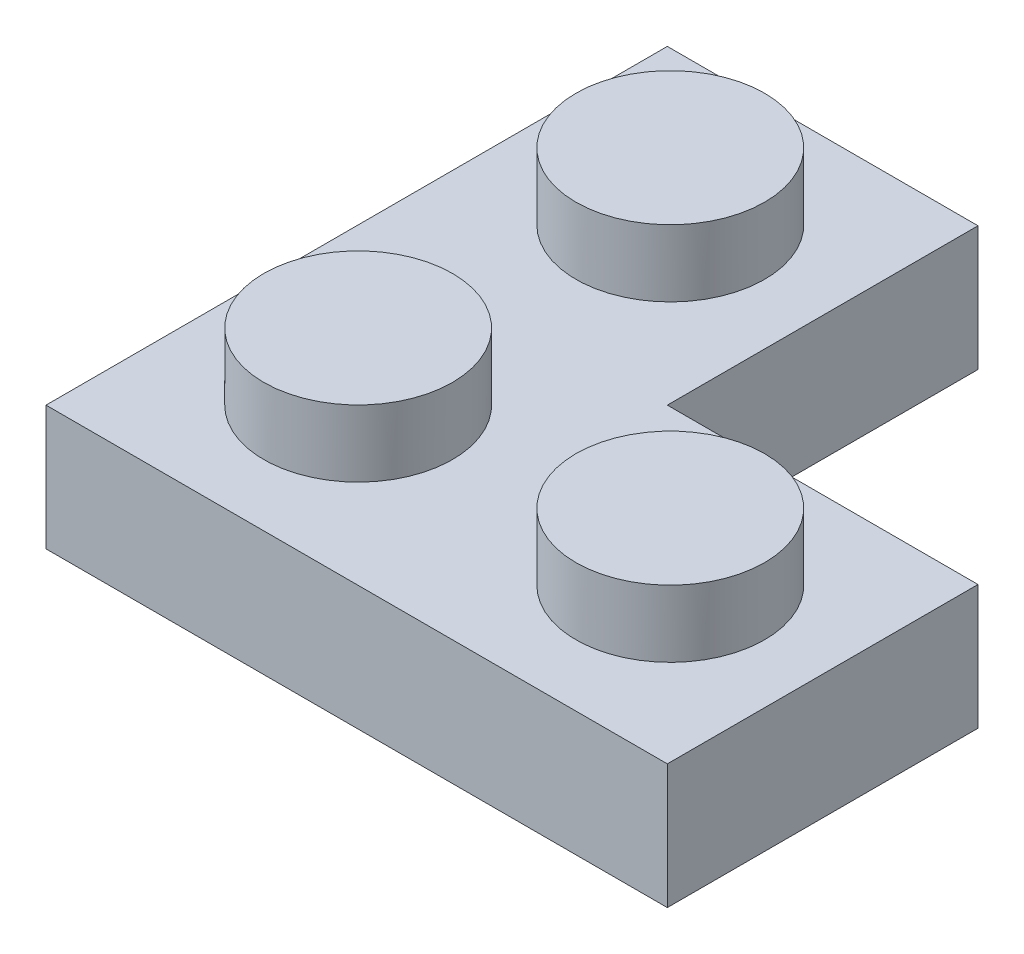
from build123d import *

# Parameters (mm, degrees)
SKETCH1_W               = 15.8
SKETCH1_H               = 15.8
BASE_EXTRUDE_DEPTH      = 3.166
SKETCH2_R               = 2.4
BOSS_EXTRUDE1_DEPTH     = 1.7
LPATTERN4_COUNT         = 2
LPATTERN4_PITCH         = 7.9375
LPATTERN4_COUNT_DIR2    = 2
LPATTERN4_PITCH_DIR2    = 7.9375
CUT_EXTRUDE1_DEPTH      = 7.9375
CUT_EXTRUDE1_DEPTH_BACK = 12.612215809
SHELL1_T                = -1.5875
SKETCH4_R               = 1.27
BOSS_EXTRUDE2_DEPTH     = 1.5785
CUT_EXTRUDE2_START      = -1.5785
SKETCH5_R               = 0.635
CUT_EXTRUDE2_DEPTH      = 1.5785


with BuildPart() as part:
    # Sketch1 → Base-Extrude (new body)
    with BuildSketch(Plane(origin=(0, 0, 0), x_dir=(1, 0, 0), z_dir=(0, 1, 0))):
        Rectangle(SKETCH1_W, SKETCH1_H)
    extrude(amount=BASE_EXTRUDE_DEPTH)

    # Sketch2 → Boss-Extrude1 (add)
    with BuildSketch(Plane(origin=(0, 3.166, 0), x_dir=(-1, 0, 0), z_dir=(0, 1, 0))):
        with Locations(Location((3.93125, 3.93125, 0), (0, 0, 270))):
            Circle(SKETCH2_R)
    boss_extrude1 = extrude(amount=BOSS_EXTRUDE1_DEPTH)

    # LPattern4: Boss-Extrude1 2 × 2
    with Locations(*[(i * LPATTERN4_PITCH, 0, -j * LPATTERN4_PITCH_DIR2) for i in range(LPATTERN4_COUNT) for j in range(LPATTERN4_COUNT_DIR2) if (i, j) != (0, 0)]):
        add(boss_extrude1)

    # Sketch3 → Cut-Extrude1 (cut, two sides: drawn at the far end of the back side and taken through both)
    with BuildSketch(Plane(origin=(0, 3.166, 0), x_dir=(-1, 0, 0), z_dir=(0, 1, 0)).offset(-CUT_EXTRUDE1_DEPTH_BACK)):
        Polygon((0, -53.229874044), (0, -7.9), (0, 0), (-7.9, 0), (-53.229874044, 0), (-117.335996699, -64.106122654), (-64.106122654, -117.335996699), align=None)
    extrude(amount=CUT_EXTRUDE1_DEPTH + CUT_EXTRUDE1_DEPTH_BACK, mode=Mode.SUBTRACT)

    # Shell1
    shell1_openings = [part.faces().sort_by_distance(p)[0] for p in [
        (-1.316666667, 0, 1.316666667),
    ]]
    offset(amount=SHELL1_T, openings=shell1_openings, kind=Kind.INTERSECTION)

    # Sketch4 → Boss-Extrude2 (add)
    with BuildSketch(Plane.XZ.offset(-1.5785)):
        with Locations(Location((-3.81, 0, 0), (0, 0, 270))):
            Circle(SKETCH4_R)
        with Locations(Location((0, 3.81, 0), (0, 0, 270))):
            Circle(SKETCH4_R)
    extrude(amount=BOSS_EXTRUDE2_DEPTH)

    # Sketch5 → Cut-Extrude2 (cut)
    with BuildSketch(Plane.XZ.offset(CUT_EXTRUDE2_START)):
        with Locations(Location((0, 3.81, 0), (0, 0, 270))):
            Circle(SKETCH5_R)
        with Locations(Location((-3.81, 0, 0), (0, 0, 270))):
            Circle(SKETCH5_R)
    extrude(amount=CUT_EXTRUDE2_DEPTH, mode=Mode.SUBTRACT)


solid = part.part
